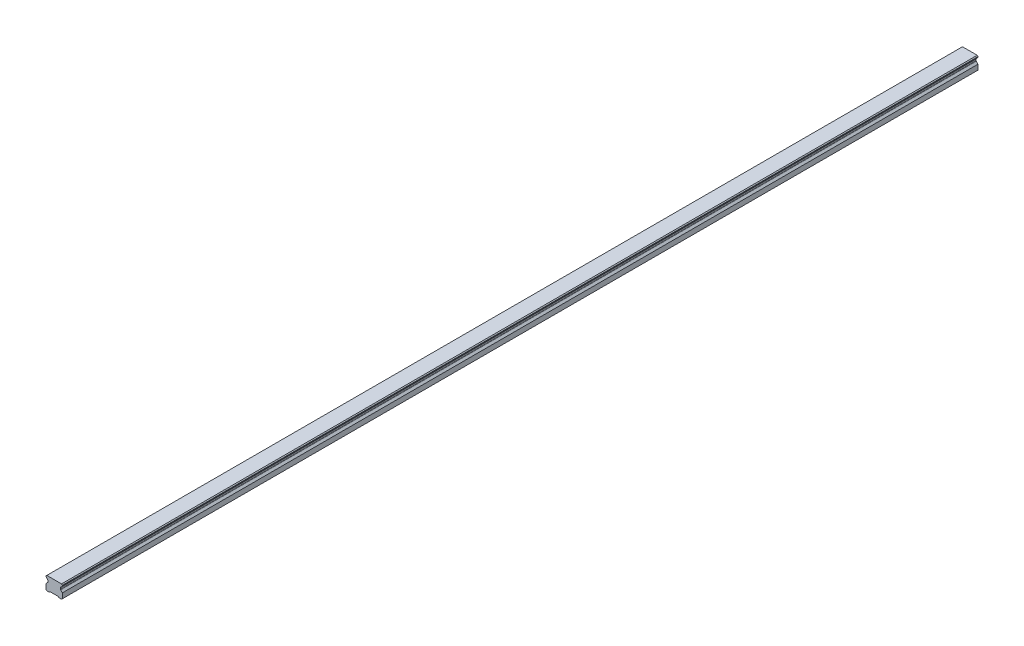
from build123d import *

# Parameters (mm, degrees)
SKETCH1_W           = 20
SKETCH1_H           = 16.3
BOSS_EXTRUDE1_DEPTH = 560
CUT_EXTRUDE1_DEPTH  = 1121.163242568
CHAMFER1_SIZE       = 1
FILLET1_R           = 1
CUT_EXTRUDE2_DEPTH  = 1121.163242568
SKETCH5_R           = 3
SKETCH5_R_2         = 2.5
CUT_EXTRUDE5_DEPTH  = 10
SKETCH5_2_R         = 2.5
CUT_EXTRUDE6_DEPTH  = 13
LPATTERN2_COUNT     = 19
LPATTERN2_PITCH     = 60


with BuildPart() as part:
    # Sketch1 → Boss-Extrude1 (new, symmetric)
    with BuildSketch(Plane.XY):
        with Locations((0, 8.15)):
            Rectangle(SKETCH1_W, SKETCH1_H)
    extrude(amount=BOSS_EXTRUDE1_DEPTH, both=True)

    # Sketch2 → Cut-Extrude1 (cut, through all)
    with BuildSketch(Plane.XY.offset(560)):
        Polygon((-10, 14.3), (-10, 7.3), (-7.666666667, 9.633333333), (-7.666666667, 11.966666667), align=None)
        Polygon((7.666666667, 11.966666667), (10, 14.3), (10, 7.3), (7.666666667, 9.633333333), align=None)
    extrude(amount=-CUT_EXTRUDE1_DEPTH, mode=Mode.SUBTRACT)

    # Chamfer1
    chamfer1_edges = [part.edges().sort_by_distance(p)[0] for p in [
        (-10, 16.3, 0),
        (10, 16.3, 0),
        (10, 0, 0),
        (-10, 0, 0),
    ]]
    chamfer(chamfer1_edges, length=CHAMFER1_SIZE)

    # Fillet1
    fillet1_edges = [part.edges().sort_by_distance(p)[0] for p in [
        (-7.666666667, 11.966666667, 0),
        (-7.666666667, 9.633333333, 0),
        (7.666666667, 9.633333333, 0),
        (7.666666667, 11.966666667, 0),
    ]]
    fillet(fillet1_edges, radius=FILLET1_R)

    # Sketch3 → Cut-Extrude2 (cut, through all)
    with BuildSketch(Plane.XY.offset(560)):
        Polygon((-6, 0), (-5, 1), (5, 1), (6, 0), align=None)
    extrude(amount=-CUT_EXTRUDE2_DEPTH, mode=Mode.SUBTRACT)

    # Sketch5 → Cut-Extrude5 (cut)
    with BuildSketch(Plane.XZ.offset(-1)):
        with Locations(Location((0, 540, 0), (0, 0, 270))):
            Circle(SKETCH5_R)
        with Locations(Location((0, 540, 0), (0, 0, 270))):
            Circle(SKETCH5_R_2, mode=Mode.SUBTRACT)
    cut_extrude5 = extrude(amount=-CUT_EXTRUDE5_DEPTH, mode=Mode.SUBTRACT)

    # Sketch5_2 → Cut-Extrude6 (cut)
    with BuildSketch(Plane.XZ.offset(-1)):
        with Locations(Location((0, 540, 0), (0, 0, 270))):
            Circle(SKETCH5_2_R)
    cut_extrude6 = extrude(amount=-CUT_EXTRUDE6_DEPTH, mode=Mode.SUBTRACT)

    # Cut-Extrude7 cone 1 section (on through the dimple's axis) → Cut-Extrude7 (revolve, cut)
    with BuildSketch(Plane(origin=(0, 14, 540), x_dir=(0, 0, -1), z_dir=(1, 0, 0))):
        Polygon((0, 0), (2.5, 0), (0, 1.443375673), align=None)
    cut_extrude7 = revolve(axis=Axis((0, 14, 540), (0, 1, 0)), mode=Mode.SUBTRACT)

    # LPattern2: Cut-Extrude5, Cut-Extrude6, Cut-Extrude7 ×19
    with Locations(*[(0, 0, -i * LPATTERN2_PITCH) for i in range(1, LPATTERN2_COUNT)]):
        add(cut_extrude5, mode=Mode.SUBTRACT)
        add(cut_extrude6, mode=Mode.SUBTRACT)
        add(cut_extrude7, mode=Mode.SUBTRACT)


solid = part.part
